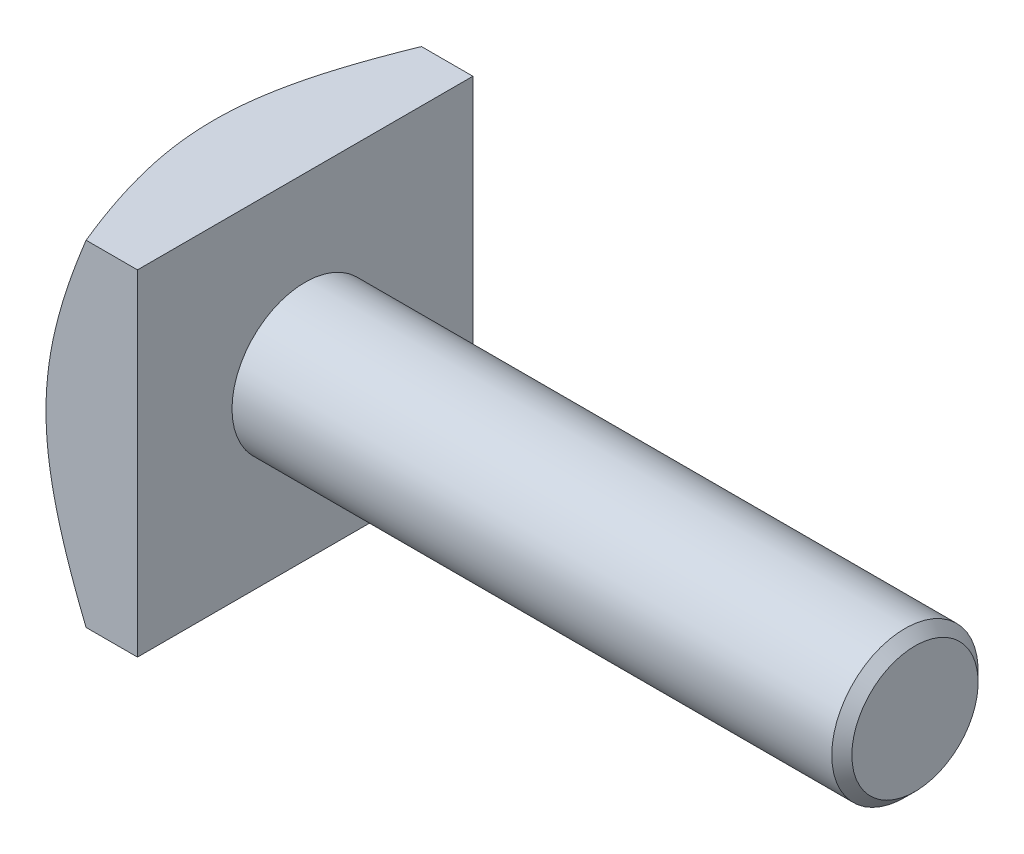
from build123d import *

# Parameters (mm, degrees)
SKETCH1_W      = 55
SKETCH1_H      = 55
BASEHEAD_DEPTH = 15


with BuildPart() as part:
    # Sketch1 → BaseHead (new body)
    with BuildSketch(Plane(origin=(0, 0, 0), x_dir=(0, 0, -1), z_dir=(1, 0, 0))):
        Rectangle(SKETCH1_W, SKETCH1_H)
    extrude(amount=BASEHEAD_DEPTH)

    # BodySke → BaseBody (revolve)
    with BuildSketch(Plane.XY, mode=Mode.PRIVATE) as basebody_sk:
        Polygon((0, 0), (115, 0), (115, 10.352), (113.352, 12), (0, 12), align=None)
    revolve(basebody_sk.sketch.rotate(Axis((0, 0, 0), (1, 0, 0)), 90), axis=Axis((0, 0, 0), (1, 0, 0)))

    # Sketch3 → HeadChamfer (revolve, cut)
    with BuildSketch(Plane.XY):
        Polygon((0, 27.5), (8.082903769, 41.5), (8.082903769, 42.5), (-1, 42.5), (-1, 27.5), align=None)
    revolve(axis=Axis((0, 0, 0), (1, 0, 0)), mode=Mode.SUBTRACT)


solid = part.part
